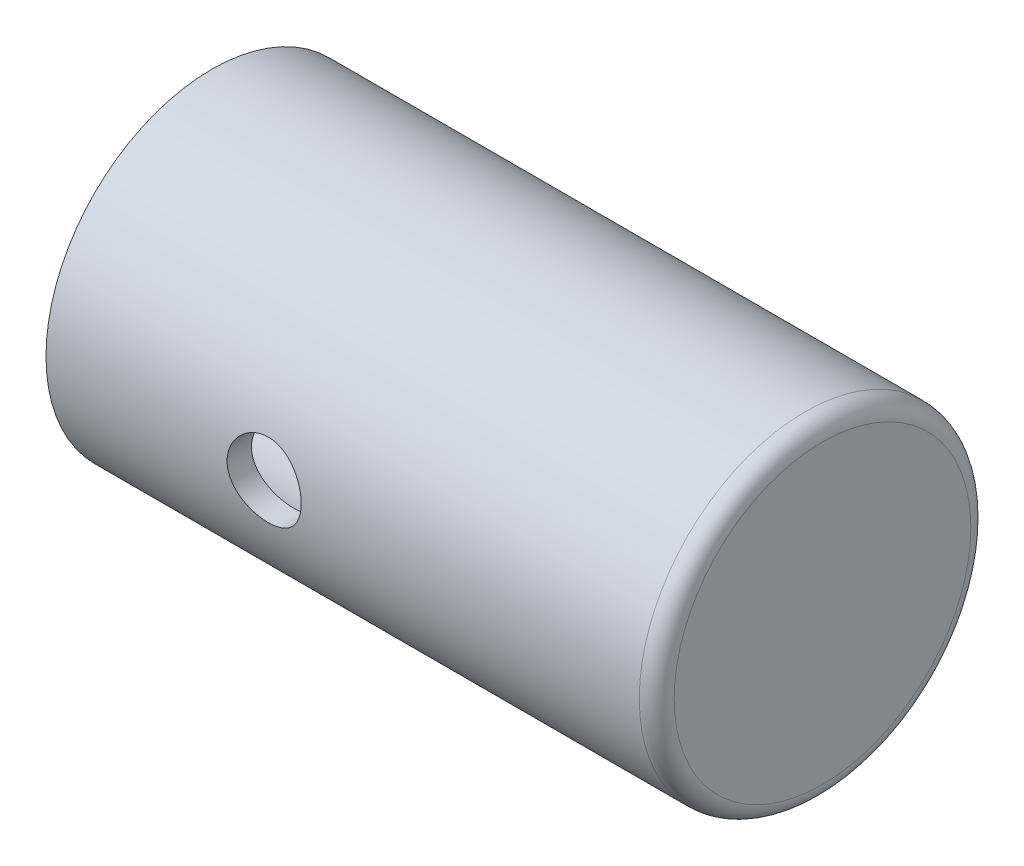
from build123d import *

# Parameters (mm, degrees)
CONG_1_R                = 2
ESQUISSE3_R             = 4.25
ENL_V_MAT_EXTRU_1_DEPTH = 75.979997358


with BuildPart() as part:
    # Esquisse2 → R_volution1 (revolve)
    with BuildSketch(Plane.XY, mode=Mode.PRIVATE) as r_volution1_sk:
        Polygon((0, 16.2), (0, 19), (70, 19), (70, 0), (66.5, 0), (66.5, 14.25), (52, 14.25), (52, 16.2), align=None)
    revolve(r_volution1_sk.sketch.rotate(Axis((-7.760828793, 0, 0), (1, 0, 0)), 90), axis=Axis((-7.760828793, 0, 0), (1, 0, 0)))

    # Cong_1
    cong_1_edges = [part.edges().sort_by_distance(p)[0] for p in [
        (70, 0, -19),
    ]]
    fillet(cong_1_edges, radius=CONG_1_R)

    # Esquisse3 → Enl_v. mat.-Extru.1 (cut, through all)
    with BuildSketch(Plane.XY):
        with Locations(Location((25, 0, 0), (0, 0, 180))):
            Circle(ESQUISSE3_R)
    extrude(amount=ENL_V_MAT_EXTRU_1_DEPTH, mode=Mode.SUBTRACT)


solid = part.part
